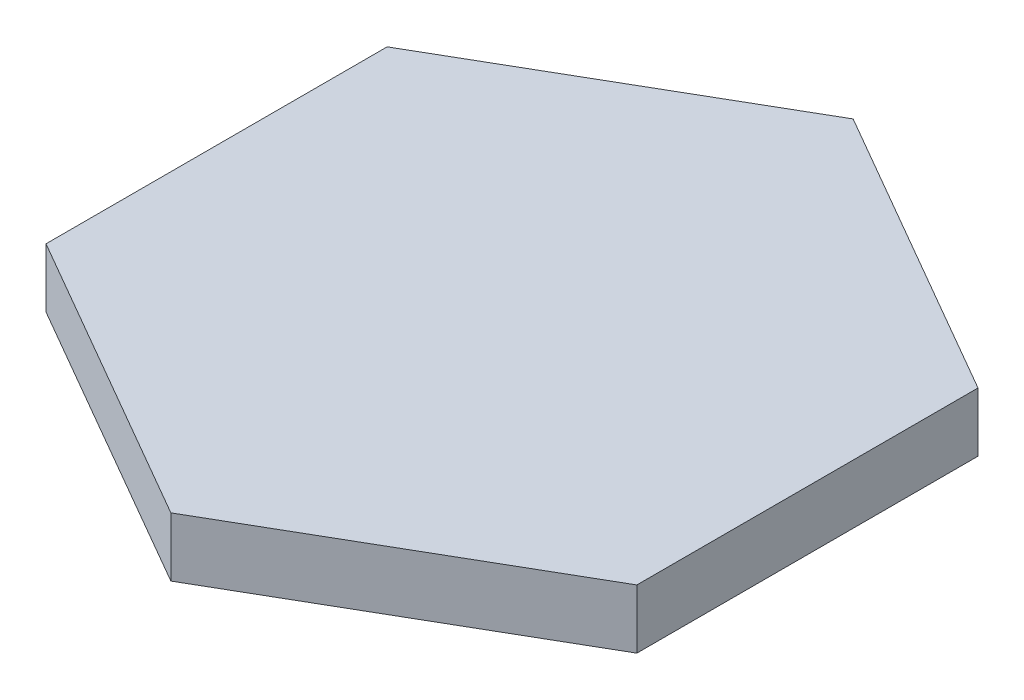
ISO-10303-21;
HEADER;
FILE_DESCRIPTION(('STEP AP214'),'2;1');
FILE_NAME('part.step','',(''),(''),'','','');
FILE_SCHEMA(('AUTOMOTIVE_DESIGN { 1 0 10303 214 1 1 1 1 }'));
ENDSEC;
DATA;
#1=APPLICATION_CONTEXT('core data for automotive mechanical design processes');
#2=APPLICATION_PROTOCOL_DEFINITION('international standard','automotive_design',2000,#1);
#3=PRODUCT_CONTEXT('',#1,'mechanical');
#4=PRODUCT('Part','Part','',(#3));
#5=PRODUCT_RELATED_PRODUCT_CATEGORY('part','',(#4));
#6=PRODUCT_DEFINITION_FORMATION('','',#4);
#7=PRODUCT_DEFINITION_CONTEXT('part definition',#1,'design');
#8=PRODUCT_DEFINITION('design','',#6,#7);
#9=PRODUCT_DEFINITION_SHAPE('','',#8);
#10=(LENGTH_UNIT() NAMED_UNIT(*) SI_UNIT(.MILLI.,.METRE.));
#11=(NAMED_UNIT(*) PLANE_ANGLE_UNIT() SI_UNIT($,.RADIAN.));
#12=(NAMED_UNIT(*) SI_UNIT($,.STERADIAN.) SOLID_ANGLE_UNIT());
#13=UNCERTAINTY_MEASURE_WITH_UNIT(LENGTH_MEASURE(1.E-05),#10,'distance_accuracy_value','');
#14=(GEOMETRIC_REPRESENTATION_CONTEXT(3) GLOBAL_UNCERTAINTY_ASSIGNED_CONTEXT((#13)) GLOBAL_UNIT_ASSIGNED_CONTEXT((#10,
#11,#12)) REPRESENTATION_CONTEXT('',''));
#15=CARTESIAN_POINT('',(0.,0.,0.));
#16=DIRECTION('',(0.,0.,1.));
#17=DIRECTION('',(1.,0.,0.));
#18=AXIS2_PLACEMENT_3D('',#15,#16,#17);
#19=CARTESIAN_POINT('',(60.,-12.,-34.6410161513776));
#20=DIRECTION('',(0.5,0.,-0.866025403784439));
#21=DIRECTION('',(-0.866025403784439,0.,-0.5));
#22=AXIS2_PLACEMENT_3D('',#19,#20,#21);
#23=PLANE('',#22);
#24=DIRECTION('',(-0.866025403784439,0.,-0.5));
#25=VECTOR('',#24,1.);
#26=CARTESIAN_POINT('',(60.,0.,-34.6410161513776));
#27=LINE('',#26,#25);
#28=CARTESIAN_POINT('',(60.,0.,-34.6410161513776));
#29=VERTEX_POINT('',#28);
#30=CARTESIAN_POINT('',(0.,0.,-69.2820323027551));
#31=VERTEX_POINT('',#30);
#32=EDGE_CURVE('E78',#29,#31,#27,.T.);
#33=ORIENTED_EDGE('',*,*,#32,.F.);
#34=DIRECTION('',(0.,1.,0.));
#35=VECTOR('',#34,1.);
#36=CARTESIAN_POINT('',(60.,-12.,-34.6410161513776));
#37=LINE('',#36,#35);
#38=CARTESIAN_POINT('',(60.,-12.,-34.6410161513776));
#39=VERTEX_POINT('',#38);
#40=EDGE_CURVE('E11',#39,#29,#37,.T.);
#41=ORIENTED_EDGE('',*,*,#40,.F.);
#42=DIRECTION('',(-0.866025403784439,0.,-0.5));
#43=VECTOR('',#42,1.);
#44=CARTESIAN_POINT('',(60.,-12.,-34.6410161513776));
#45=LINE('',#44,#43);
#46=CARTESIAN_POINT('',(0.,-12.,-69.2820323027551));
#47=VERTEX_POINT('',#46);
#48=EDGE_CURVE('E80',#39,#47,#45,.T.);
#49=ORIENTED_EDGE('',*,*,#48,.T.);
#50=DIRECTION('',(0.,1.,0.));
#51=VECTOR('',#50,1.);
#52=CARTESIAN_POINT('',(0.,-12.,-69.2820323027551));
#53=LINE('',#52,#51);
#54=EDGE_CURVE('E29',#47,#31,#53,.T.);
#55=ORIENTED_EDGE('',*,*,#54,.T.);
#56=EDGE_LOOP('',(#33,#41,#49,#55));
#57=FACE_BOUND('',#56,.T.);
#58=ADVANCED_FACE('F26',(#57),#23,.T.);
#59=CARTESIAN_POINT('',(60.,-12.,34.6410161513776));
#60=DIRECTION('',(1.,0.,0.));
#61=DIRECTION('',(0.,0.,-1.));
#62=AXIS2_PLACEMENT_3D('',#59,#60,#61);
#63=PLANE('',#62);
#64=DIRECTION('',(0.,0.,-1.));
#65=VECTOR('',#64,1.);
#66=CARTESIAN_POINT('',(60.,0.,34.6410161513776));
#67=LINE('',#66,#65);
#68=CARTESIAN_POINT('',(60.,0.,34.6410161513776));
#69=VERTEX_POINT('',#68);
#70=EDGE_CURVE('E96',#69,#29,#67,.T.);
#71=ORIENTED_EDGE('',*,*,#70,.F.);
#72=DIRECTION('',(0.,1.,0.));
#73=VECTOR('',#72,1.);
#74=CARTESIAN_POINT('',(60.,-12.,34.6410161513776));
#75=LINE('',#74,#73);
#76=CARTESIAN_POINT('',(60.,-12.,34.6410161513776));
#77=VERTEX_POINT('',#76);
#78=EDGE_CURVE('E34',#77,#69,#75,.T.);
#79=ORIENTED_EDGE('',*,*,#78,.F.);
#80=DIRECTION('',(0.,0.,-1.));
#81=VECTOR('',#80,1.);
#82=CARTESIAN_POINT('',(60.,-12.,34.6410161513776));
#83=LINE('',#82,#81);
#84=EDGE_CURVE('E85',#77,#39,#83,.T.);
#85=ORIENTED_EDGE('',*,*,#84,.T.);
#86=ORIENTED_EDGE('',*,*,#40,.T.);
#87=EDGE_LOOP('',(#71,#79,#85,#86));
#88=FACE_BOUND('',#87,.T.);
#89=ADVANCED_FACE('F131',(#88),#63,.T.);
#90=CARTESIAN_POINT('',(0.,-12.,69.2820323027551));
#91=DIRECTION('',(0.5,0.,0.866025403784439));
#92=DIRECTION('',(0.866025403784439,0.,-0.5));
#93=AXIS2_PLACEMENT_3D('',#90,#91,#92);
#94=PLANE('',#93);
#95=DIRECTION('',(0.866025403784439,0.,-0.5));
#96=VECTOR('',#95,1.);
#97=CARTESIAN_POINT('',(0.,0.,69.2820323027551));
#98=LINE('',#97,#96);
#99=CARTESIAN_POINT('',(0.,0.,69.2820323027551));
#100=VERTEX_POINT('',#99);
#101=EDGE_CURVE('E103',#100,#69,#98,.T.);
#102=ORIENTED_EDGE('',*,*,#101,.F.);
#103=DIRECTION('',(0.,1.,0.));
#104=VECTOR('',#103,1.);
#105=CARTESIAN_POINT('',(0.,-12.,69.2820323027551));
#106=LINE('',#105,#104);
#107=CARTESIAN_POINT('',(0.,-12.,69.2820323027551));
#108=VERTEX_POINT('',#107);
#109=EDGE_CURVE('E119',#108,#100,#106,.T.);
#110=ORIENTED_EDGE('',*,*,#109,.F.);
#111=DIRECTION('',(0.866025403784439,0.,-0.5));
#112=VECTOR('',#111,1.);
#113=CARTESIAN_POINT('',(0.,-12.,69.2820323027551));
#114=LINE('',#113,#112);
#115=EDGE_CURVE('E115',#108,#77,#114,.T.);
#116=ORIENTED_EDGE('',*,*,#115,.T.);
#117=ORIENTED_EDGE('',*,*,#78,.T.);
#118=EDGE_LOOP('',(#102,#110,#116,#117));
#119=FACE_BOUND('',#118,.T.);
#120=ADVANCED_FACE('F136',(#119),#94,.T.);
#121=CARTESIAN_POINT('',(-60.,-12.,34.6410161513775));
#122=DIRECTION('',(-0.5,0.,0.866025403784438));
#123=DIRECTION('',(0.866025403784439,0.,0.5));
#124=AXIS2_PLACEMENT_3D('',#121,#122,#123);
#125=PLANE('',#124);
#126=DIRECTION('',(0.866025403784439,0.,0.5));
#127=VECTOR('',#126,1.);
#128=CARTESIAN_POINT('',(-60.,0.,34.6410161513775));
#129=LINE('',#128,#127);
#130=CARTESIAN_POINT('',(-60.,0.,34.6410161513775));
#131=VERTEX_POINT('',#130);
#132=EDGE_CURVE('E100',#131,#100,#129,.T.);
#133=ORIENTED_EDGE('',*,*,#132,.F.);
#134=DIRECTION('',(0.,1.,0.));
#135=VECTOR('',#134,1.);
#136=CARTESIAN_POINT('',(-60.,-12.,34.6410161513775));
#137=LINE('',#136,#135);
#138=CARTESIAN_POINT('',(-60.,-12.,34.6410161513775));
#139=VERTEX_POINT('',#138);
#140=EDGE_CURVE('E121',#139,#131,#137,.T.);
#141=ORIENTED_EDGE('',*,*,#140,.F.);
#142=DIRECTION('',(0.866025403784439,0.,0.5));
#143=VECTOR('',#142,1.);
#144=CARTESIAN_POINT('',(-60.,-12.,34.6410161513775));
#145=LINE('',#144,#143);
#146=EDGE_CURVE('E112',#139,#108,#145,.T.);
#147=ORIENTED_EDGE('',*,*,#146,.T.);
#148=ORIENTED_EDGE('',*,*,#109,.T.);
#149=EDGE_LOOP('',(#133,#141,#147,#148));
#150=FACE_BOUND('',#149,.T.);
#151=ADVANCED_FACE('F128',(#150),#125,.T.);
#152=CARTESIAN_POINT('',(-60.,-12.,-34.6410161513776));
#153=DIRECTION('',(-1.,0.,0.));
#154=DIRECTION('',(0.,0.,1.));
#155=AXIS2_PLACEMENT_3D('',#152,#153,#154);
#156=PLANE('',#155);
#157=DIRECTION('',(0.,0.,1.));
#158=VECTOR('',#157,1.);
#159=CARTESIAN_POINT('',(-60.,0.,-34.6410161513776));
#160=LINE('',#159,#158);
#161=CARTESIAN_POINT('',(-60.,0.,-34.6410161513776));
#162=VERTEX_POINT('',#161);
#163=EDGE_CURVE('E92',#162,#131,#160,.T.);
#164=ORIENTED_EDGE('',*,*,#163,.F.);
#165=DIRECTION('',(0.,1.,0.));
#166=VECTOR('',#165,1.);
#167=CARTESIAN_POINT('',(-60.,-12.,-34.6410161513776));
#168=LINE('',#167,#166);
#169=CARTESIAN_POINT('',(-60.,-12.,-34.6410161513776));
#170=VERTEX_POINT('',#169);
#171=EDGE_CURVE('E84',#170,#162,#168,.T.);
#172=ORIENTED_EDGE('',*,*,#171,.F.);
#173=DIRECTION('',(0.,0.,1.));
#174=VECTOR('',#173,1.);
#175=CARTESIAN_POINT('',(-60.,-12.,-34.6410161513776));
#176=LINE('',#175,#174);
#177=EDGE_CURVE('E109',#170,#139,#176,.T.);
#178=ORIENTED_EDGE('',*,*,#177,.T.);
#179=ORIENTED_EDGE('',*,*,#140,.T.);
#180=EDGE_LOOP('',(#164,#172,#178,#179));
#181=FACE_BOUND('',#180,.T.);
#182=ADVANCED_FACE('F124',(#181),#156,.T.);
#183=CARTESIAN_POINT('',(0.,-12.,-69.2820323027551));
#184=DIRECTION('',(-0.5,0.,-0.866025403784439));
#185=DIRECTION('',(-0.866025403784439,0.,0.5));
#186=AXIS2_PLACEMENT_3D('',#183,#184,#185);
#187=PLANE('',#186);
#188=DIRECTION('',(-0.866025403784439,0.,0.5));
#189=VECTOR('',#188,1.);
#190=CARTESIAN_POINT('',(0.,0.,-69.2820323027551));
#191=LINE('',#190,#189);
#192=EDGE_CURVE('E87',#31,#162,#191,.T.);
#193=ORIENTED_EDGE('',*,*,#192,.F.);
#194=ORIENTED_EDGE('',*,*,#54,.F.);
#195=DIRECTION('',(-0.866025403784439,0.,0.5));
#196=VECTOR('',#195,1.);
#197=CARTESIAN_POINT('',(0.,-12.,-69.2820323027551));
#198=LINE('',#197,#196);
#199=EDGE_CURVE('E107',#47,#170,#198,.T.);
#200=ORIENTED_EDGE('',*,*,#199,.T.);
#201=ORIENTED_EDGE('',*,*,#171,.T.);
#202=EDGE_LOOP('',(#193,#194,#200,#201));
#203=FACE_BOUND('',#202,.T.);
#204=ADVANCED_FACE('F88',(#203),#187,.T.);
#205=CARTESIAN_POINT('',(-60.,-12.,-103.923048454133));
#206=DIRECTION('',(0.,1.,0.));
#207=DIRECTION('',(0.,0.,1.));
#208=AXIS2_PLACEMENT_3D('',#205,#206,#207);
#209=PLANE('',#208);
#210=ORIENTED_EDGE('',*,*,#48,.F.);
#211=ORIENTED_EDGE('',*,*,#84,.F.);
#212=ORIENTED_EDGE('',*,*,#115,.F.);
#213=ORIENTED_EDGE('',*,*,#146,.F.);
#214=ORIENTED_EDGE('',*,*,#177,.F.);
#215=ORIENTED_EDGE('',*,*,#199,.F.);
#216=EDGE_LOOP('',(#210,#211,#212,#213,#214,#215));
#217=FACE_BOUND('',#216,.T.);
#218=ADVANCED_FACE('F135',(#217),#209,.F.);
#219=CARTESIAN_POINT('',(-60.,0.,-103.923048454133));
#220=DIRECTION('',(0.,1.,0.));
#221=DIRECTION('',(0.,0.,1.));
#222=AXIS2_PLACEMENT_3D('',#219,#220,#221);
#223=PLANE('',#222);
#224=ORIENTED_EDGE('',*,*,#32,.T.);
#225=ORIENTED_EDGE('',*,*,#192,.T.);
#226=ORIENTED_EDGE('',*,*,#163,.T.);
#227=ORIENTED_EDGE('',*,*,#132,.T.);
#228=ORIENTED_EDGE('',*,*,#101,.T.);
#229=ORIENTED_EDGE('',*,*,#70,.T.);
#230=EDGE_LOOP('',(#224,#225,#226,#227,#228,#229));
#231=FACE_BOUND('',#230,.T.);
#232=ADVANCED_FACE('F94',(#231),#223,.T.);
#233=CLOSED_SHELL('',(#58,#89,#120,#151,#182,#204,#218,#232));
#234=MANIFOLD_SOLID_BREP('B2',#233);
#235=ADVANCED_BREP_SHAPE_REPRESENTATION('',(#18,#234),#14);
#236=SHAPE_DEFINITION_REPRESENTATION(#9,#235);
ENDSEC;
END-ISO-10303-21;
